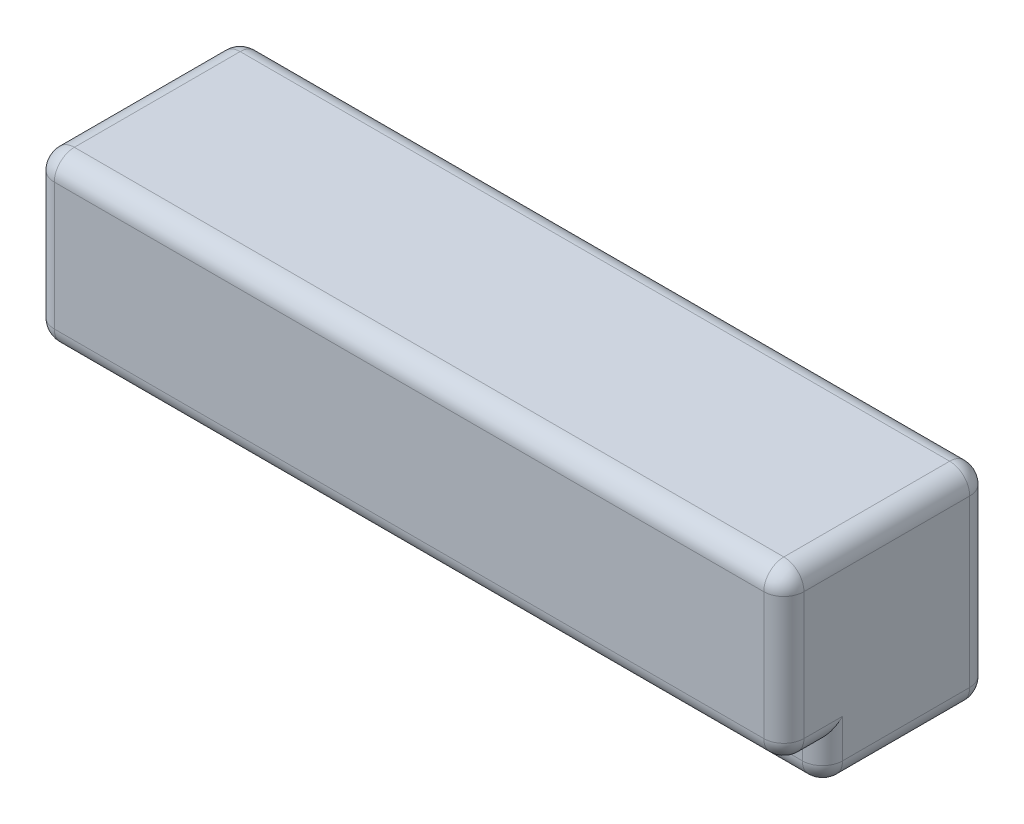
ISO-10303-21;
HEADER;
FILE_DESCRIPTION(('STEP AP214'),'2;1');
FILE_NAME('part.step','',(''),(''),'','','');
FILE_SCHEMA(('AUTOMOTIVE_DESIGN { 1 0 10303 214 1 1 1 1 }'));
ENDSEC;
DATA;
#1=APPLICATION_CONTEXT('core data for automotive mechanical design processes');
#2=APPLICATION_PROTOCOL_DEFINITION('international standard','automotive_design',2000,#1);
#3=PRODUCT_CONTEXT('',#1,'mechanical');
#4=PRODUCT('Part','Part','',(#3));
#5=PRODUCT_RELATED_PRODUCT_CATEGORY('part','',(#4));
#6=PRODUCT_DEFINITION_FORMATION('','',#4);
#7=PRODUCT_DEFINITION_CONTEXT('part definition',#1,'design');
#8=PRODUCT_DEFINITION('design','',#6,#7);
#9=PRODUCT_DEFINITION_SHAPE('','',#8);
#10=(LENGTH_UNIT() NAMED_UNIT(*) SI_UNIT(.MILLI.,.METRE.));
#11=(NAMED_UNIT(*) PLANE_ANGLE_UNIT() SI_UNIT($,.RADIAN.));
#12=(NAMED_UNIT(*) SI_UNIT($,.STERADIAN.) SOLID_ANGLE_UNIT());
#13=UNCERTAINTY_MEASURE_WITH_UNIT(LENGTH_MEASURE(1.E-05),#10,'distance_accuracy_value','');
#14=(GEOMETRIC_REPRESENTATION_CONTEXT(3) GLOBAL_UNCERTAINTY_ASSIGNED_CONTEXT((#13)) GLOBAL_UNIT_ASSIGNED_CONTEXT((#10,
#11,#12)) REPRESENTATION_CONTEXT('',''));
#15=CARTESIAN_POINT('',(0.,0.,0.));
#16=DIRECTION('',(0.,0.,1.));
#17=DIRECTION('',(1.,0.,0.));
#18=AXIS2_PLACEMENT_3D('',#15,#16,#17);
#19=CARTESIAN_POINT('',(-18.4912,-3.175,3.175));
#20=DIRECTION('',(0.,0.,1.));
#21=DIRECTION('',(1.,0.,0.));
#22=AXIS2_PLACEMENT_3D('',#19,#20,#21);
#23=PLANE('',#22);
#24=DIRECTION('',(1.,0.,0.));
#25=VECTOR('',#24,1.);
#26=CARTESIAN_POINT('',(-18.4912,-4.0894,3.175));
#27=LINE('',#26,#25);
#28=CARTESIAN_POINT('',(17.5006,-4.0894,3.175));
#29=VERTEX_POINT('',#28);
#30=CARTESIAN_POINT('',(-17.5006,-4.0894,3.175));
#31=VERTEX_POINT('',#30);
#32=EDGE_CURVE('E312',#29,#31,#27,.F.);
#33=ORIENTED_EDGE('',*,*,#32,.F.);
#34=DIRECTION('',(0.,1.,0.));
#35=VECTOR('',#34,1.);
#36=CARTESIAN_POINT('',(17.5006,-3.175,3.175));
#37=LINE('',#36,#35);
#38=CARTESIAN_POINT('',(17.5006,-3.175,3.175));
#39=VERTEX_POINT('',#38);
#40=EDGE_CURVE('E143',#29,#39,#37,.T.);
#41=ORIENTED_EDGE('',*,*,#40,.T.);
#42=DIRECTION('',(1.,0.,0.));
#43=VECTOR('',#42,1.);
#44=CARTESIAN_POINT('',(-18.4912,-3.175,3.175));
#45=LINE('',#44,#43);
#46=CARTESIAN_POINT('',(-17.5006,-3.175,3.175));
#47=VERTEX_POINT('',#46);
#48=EDGE_CURVE('E146',#47,#39,#45,.T.);
#49=ORIENTED_EDGE('',*,*,#48,.F.);
#50=DIRECTION('',(0.,1.,0.));
#51=VECTOR('',#50,1.);
#52=CARTESIAN_POINT('',(-17.5006,-3.175,3.175));
#53=LINE('',#52,#51);
#54=EDGE_CURVE('E133',#47,#31,#53,.F.);
#55=ORIENTED_EDGE('',*,*,#54,.T.);
#56=EDGE_LOOP('',(#33,#41,#49,#55));
#57=FACE_BOUND('',#56,.T.);
#58=ADVANCED_FACE('F16',(#57),#23,.T.);
#59=CARTESIAN_POINT('',(-18.4912,-4.0894,2.1844));
#60=DIRECTION('',(1.,0.,0.));
#61=DIRECTION('',(0.,0.,-1.));
#62=AXIS2_PLACEMENT_3D('',#59,#60,#61);
#63=CYLINDRICAL_SURFACE('',#62,0.9906);
#64=DIRECTION('',(1.,0.,0.));
#65=VECTOR('',#64,1.);
#66=CARTESIAN_POINT('',(-18.4912,-5.08,2.1844));
#67=LINE('',#66,#65);
#68=CARTESIAN_POINT('',(17.5006,-5.08,2.1844));
#69=VERTEX_POINT('',#68);
#70=CARTESIAN_POINT('',(-17.5006,-5.08,2.18439999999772));
#71=VERTEX_POINT('',#70);
#72=EDGE_CURVE('E259',#69,#71,#67,.F.);
#73=ORIENTED_EDGE('',*,*,#72,.F.);
#74=CARTESIAN_POINT('',(17.5006,-4.0894,2.1844));
#75=DIRECTION('',(1.,0.,0.));
#76=DIRECTION('',(0.,0.,-1.));
#77=AXIS2_PLACEMENT_3D('',#74,#75,#76);
#78=CIRCLE('',#77,0.9906);
#79=EDGE_CURVE('E309',#69,#29,#78,.F.);
#80=ORIENTED_EDGE('',*,*,#79,.T.);
#81=ORIENTED_EDGE('',*,*,#32,.T.);
#82=CARTESIAN_POINT('',(-17.5006,-4.0894,2.1844));
#83=DIRECTION('',(1.,0.,0.));
#84=DIRECTION('',(0.,0.,-1.));
#85=AXIS2_PLACEMENT_3D('',#82,#83,#84);
#86=CIRCLE('',#85,0.9906);
#87=EDGE_CURVE('E151',#71,#31,#86,.F.);
#88=ORIENTED_EDGE('',*,*,#87,.F.);
#89=EDGE_LOOP('',(#73,#80,#81,#88));
#90=FACE_BOUND('',#89,.T.);
#91=ADVANCED_FACE('F288',(#90),#63,.T.);
#92=CARTESIAN_POINT('',(-17.5006,-4.0894,-4.0894));
#93=DIRECTION('',(1.,0.,0.));
#94=DIRECTION('',(0.,0.,-1.));
#95=AXIS2_PLACEMENT_3D('',#92,#93,#94);
#96=SPHERICAL_SURFACE('',#95,0.9906);
#97=CARTESIAN_POINT('',(-17.5006,-4.0894,-4.0894));
#98=DIRECTION('',(0.,-1.,0.));
#99=DIRECTION('',(0.,0.,-1.));
#100=AXIS2_PLACEMENT_3D('',#97,#98,#99);
#101=CIRCLE('',#100,0.990599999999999);
#102=CARTESIAN_POINT('',(-17.5006,-4.0894,-5.08));
#103=VERTEX_POINT('',#102);
#104=CARTESIAN_POINT('',(-18.4912,-4.0894,-4.0894));
#105=VERTEX_POINT('',#104);
#106=EDGE_CURVE('E162',#103,#105,#101,.F.);
#107=ORIENTED_EDGE('',*,*,#106,.F.);
#108=CARTESIAN_POINT('',(-17.5006,-4.0894,-4.0894));
#109=DIRECTION('',(1.,0.,0.));
#110=DIRECTION('',(0.,0.,-1.));
#111=AXIS2_PLACEMENT_3D('',#108,#109,#110);
#112=CIRCLE('',#111,0.990599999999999);
#113=CARTESIAN_POINT('',(-17.5006,-5.08,-4.0894));
#114=VERTEX_POINT('',#113);
#115=EDGE_CURVE('E244',#114,#103,#112,.T.);
#116=ORIENTED_EDGE('',*,*,#115,.F.);
#117=CARTESIAN_POINT('',(-17.5006,-4.0894,-4.0894));
#118=DIRECTION('',(0.,0.,1.));
#119=DIRECTION('',(1.,0.,0.));
#120=AXIS2_PLACEMENT_3D('',#117,#118,#119);
#121=CIRCLE('',#120,0.990600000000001);
#122=EDGE_CURVE('E197',#105,#114,#121,.T.);
#123=ORIENTED_EDGE('',*,*,#122,.F.);
#124=EDGE_LOOP('',(#107,#116,#123));
#125=FACE_BOUND('',#124,.T.);
#126=ADVANCED_FACE('F284',(#125),#96,.T.);
#127=CARTESIAN_POINT('',(-17.5006,-4.0894,2.1844));
#128=DIRECTION('',(1.,0.,0.));
#129=DIRECTION('',(0.,0.,-1.));
#130=AXIS2_PLACEMENT_3D('',#127,#128,#129);
#131=SPHERICAL_SURFACE('',#130,0.9906);
#132=ORIENTED_EDGE('',*,*,#87,.T.);
#133=CARTESIAN_POINT('',(-17.5006,-4.0894,2.1844));
#134=DIRECTION('',(0.,1.,0.));
#135=DIRECTION('',(0.,0.,1.));
#136=AXIS2_PLACEMENT_3D('',#133,#134,#135);
#137=CIRCLE('',#136,0.9906);
#138=CARTESIAN_POINT('',(-18.4912,-4.0894,2.1844));
#139=VERTEX_POINT('',#138);
#140=EDGE_CURVE('E139',#139,#31,#137,.T.);
#141=ORIENTED_EDGE('',*,*,#140,.F.);
#142=CARTESIAN_POINT('',(-17.5006,-4.0894,2.1844));
#143=DIRECTION('',(0.,0.,1.));
#144=DIRECTION('',(1.,0.,0.));
#145=AXIS2_PLACEMENT_3D('',#142,#143,#144);
#146=CIRCLE('',#145,0.990600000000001);
#147=EDGE_CURVE('E191',#71,#139,#146,.F.);
#148=ORIENTED_EDGE('',*,*,#147,.F.);
#149=EDGE_LOOP('',(#132,#141,#148));
#150=FACE_BOUND('',#149,.T.);
#151=ADVANCED_FACE('F280',(#150),#131,.T.);
#152=CARTESIAN_POINT('',(-17.5006,-2.1844,4.0894));
#153=DIRECTION('',(1.,0.,0.));
#154=DIRECTION('',(0.,0.,-1.));
#155=AXIS2_PLACEMENT_3D('',#152,#153,#154);
#156=SPHERICAL_SURFACE('',#155,0.9906);
#157=CARTESIAN_POINT('',(-17.5006,-2.1844,4.0894));
#158=DIRECTION('',(1.,0.,0.));
#159=DIRECTION('',(0.,0.,-1.));
#160=AXIS2_PLACEMENT_3D('',#157,#158,#159);
#161=CIRCLE('',#160,0.9906);
#162=CARTESIAN_POINT('',(-17.5006,-2.1844,5.08));
#163=VERTEX_POINT('',#162);
#164=CARTESIAN_POINT('',(-17.5006,-3.175,4.0894));
#165=VERTEX_POINT('',#164);
#166=EDGE_CURVE('E170',#163,#165,#161,.T.);
#167=ORIENTED_EDGE('',*,*,#166,.F.);
#168=CARTESIAN_POINT('',(-17.5006,-2.1844,4.0894));
#169=DIRECTION('',(0.,1.,0.));
#170=DIRECTION('',(0.,0.,1.));
#171=AXIS2_PLACEMENT_3D('',#168,#169,#170);
#172=CIRCLE('',#171,0.990599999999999);
#173=CARTESIAN_POINT('',(-18.4912,-2.1844,4.0894));
#174=VERTEX_POINT('',#173);
#175=EDGE_CURVE('E168',#174,#163,#172,.T.);
#176=ORIENTED_EDGE('',*,*,#175,.F.);
#177=CARTESIAN_POINT('',(-17.5006,-2.1844,4.0894));
#178=DIRECTION('',(0.,0.,1.));
#179=DIRECTION('',(1.,0.,0.));
#180=AXIS2_PLACEMENT_3D('',#177,#178,#179);
#181=CIRCLE('',#180,0.990600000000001);
#182=EDGE_CURVE('E161',#165,#174,#181,.F.);
#183=ORIENTED_EDGE('',*,*,#182,.F.);
#184=EDGE_LOOP('',(#167,#176,#183));
#185=FACE_BOUND('',#184,.T.);
#186=ADVANCED_FACE('F277',(#185),#156,.T.);
#187=CARTESIAN_POINT('',(-18.4912,-3.175,5.08));
#188=DIRECTION('',(0.,-1.,0.));
#189=DIRECTION('',(0.,0.,-1.));
#190=AXIS2_PLACEMENT_3D('',#187,#188,#189);
#191=PLANE('',#190);
#192=ORIENTED_EDGE('',*,*,#48,.T.);
#193=DIRECTION('',(0.,0.,-1.));
#194=VECTOR('',#193,1.);
#195=CARTESIAN_POINT('',(17.5006,-3.175,5.08));
#196=LINE('',#195,#194);
#197=CARTESIAN_POINT('',(17.5006,-3.175,4.0894));
#198=VERTEX_POINT('',#197);
#199=EDGE_CURVE('E150',#39,#198,#196,.F.);
#200=ORIENTED_EDGE('',*,*,#199,.T.);
#201=DIRECTION('',(1.,0.,0.));
#202=VECTOR('',#201,1.);
#203=CARTESIAN_POINT('',(-18.4912,-3.175,4.0894));
#204=LINE('',#203,#202);
#205=EDGE_CURVE('E158',#165,#198,#204,.T.);
#206=ORIENTED_EDGE('',*,*,#205,.F.);
#207=DIRECTION('',(0.,0.,1.));
#208=VECTOR('',#207,1.);
#209=CARTESIAN_POINT('',(-17.5006,-3.175,5.08));
#210=LINE('',#209,#208);
#211=EDGE_CURVE('E155',#47,#165,#210,.T.);
#212=ORIENTED_EDGE('',*,*,#211,.F.);
#213=EDGE_LOOP('',(#192,#200,#206,#212));
#214=FACE_BOUND('',#213,.T.);
#215=ADVANCED_FACE('F156',(#214),#191,.T.);
#216=CARTESIAN_POINT('',(-18.4912,-5.08,3.175));
#217=DIRECTION('',(0.,-1.,0.));
#218=DIRECTION('',(0.,0.,-1.));
#219=AXIS2_PLACEMENT_3D('',#216,#217,#218);
#220=PLANE('',#219);
#221=DIRECTION('',(1.,0.,0.));
#222=VECTOR('',#221,1.);
#223=CARTESIAN_POINT('',(-18.4912,-5.08,-4.0894));
#224=LINE('',#223,#222);
#225=CARTESIAN_POINT('',(17.5006,-5.08,-4.08939999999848));
#226=VERTEX_POINT('',#225);
#227=EDGE_CURVE('E262',#226,#114,#224,.F.);
#228=ORIENTED_EDGE('',*,*,#227,.F.);
#229=DIRECTION('',(0.,0.,-1.));
#230=VECTOR('',#229,1.);
#231=CARTESIAN_POINT('',(17.5006,-5.08,5.08));
#232=LINE('',#231,#230);
#233=EDGE_CURVE('E252',#69,#226,#232,.T.);
#234=ORIENTED_EDGE('',*,*,#233,.F.);
#235=ORIENTED_EDGE('',*,*,#72,.T.);
#236=DIRECTION('',(0.,0.,1.));
#237=VECTOR('',#236,1.);
#238=CARTESIAN_POINT('',(-17.5006,-5.08,3.175));
#239=LINE('',#238,#237);
#240=EDGE_CURVE('E194',#114,#71,#239,.T.);
#241=ORIENTED_EDGE('',*,*,#240,.F.);
#242=EDGE_LOOP('',(#228,#234,#235,#241));
#243=FACE_BOUND('',#242,.T.);
#244=ADVANCED_FACE('F230',(#243),#220,.T.);
#245=CARTESIAN_POINT('',(17.5006,-4.0894,-4.0894));
#246=DIRECTION('',(1.,0.,0.));
#247=DIRECTION('',(0.,0.,-1.));
#248=AXIS2_PLACEMENT_3D('',#245,#246,#247);
#249=SPHERICAL_SURFACE('',#248,0.9906);
#250=CARTESIAN_POINT('',(17.5006,-4.0894,-4.0894));
#251=DIRECTION('',(1.,0.,0.));
#252=DIRECTION('',(0.,0.,-1.));
#253=AXIS2_PLACEMENT_3D('',#250,#251,#252);
#254=CIRCLE('',#253,0.990599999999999);
#255=CARTESIAN_POINT('',(17.5006,-4.0894,-5.08));
#256=VERTEX_POINT('',#255);
#257=EDGE_CURVE('E200',#256,#226,#254,.F.);
#258=ORIENTED_EDGE('',*,*,#257,.F.);
#259=CARTESIAN_POINT('',(17.5006,-4.0894,-4.0894));
#260=DIRECTION('',(0.,1.,0.));
#261=DIRECTION('',(0.,0.,1.));
#262=AXIS2_PLACEMENT_3D('',#259,#260,#261);
#263=CIRCLE('',#262,0.9906);
#264=CARTESIAN_POINT('',(18.4912,-4.0894,-4.0894));
#265=VERTEX_POINT('',#264);
#266=EDGE_CURVE('E375',#265,#256,#263,.T.);
#267=ORIENTED_EDGE('',*,*,#266,.F.);
#268=CARTESIAN_POINT('',(17.5006,-4.0894,-4.0894));
#269=DIRECTION('',(0.,0.,-1.));
#270=DIRECTION('',(-1.,0.,0.));
#271=AXIS2_PLACEMENT_3D('',#268,#269,#270);
#272=CIRCLE('',#271,0.990600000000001);
#273=EDGE_CURVE('E255',#226,#265,#272,.F.);
#274=ORIENTED_EDGE('',*,*,#273,.F.);
#275=EDGE_LOOP('',(#258,#267,#274));
#276=FACE_BOUND('',#275,.T.);
#277=ADVANCED_FACE('F226',(#276),#249,.T.);
#278=CARTESIAN_POINT('',(17.5006,-2.1844,4.0894));
#279=DIRECTION('',(1.,0.,0.));
#280=DIRECTION('',(0.,0.,-1.));
#281=AXIS2_PLACEMENT_3D('',#278,#279,#280);
#282=SPHERICAL_SURFACE('',#281,0.9906);
#283=CARTESIAN_POINT('',(17.5006,-2.1844,4.0894));
#284=DIRECTION('',(0.,0.,-1.));
#285=DIRECTION('',(-1.,0.,0.));
#286=AXIS2_PLACEMENT_3D('',#283,#284,#285);
#287=CIRCLE('',#286,0.990600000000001);
#288=CARTESIAN_POINT('',(18.4912,-2.1844,4.0894));
#289=VERTEX_POINT('',#288);
#290=EDGE_CURVE('E327',#289,#198,#287,.T.);
#291=ORIENTED_EDGE('',*,*,#290,.F.);
#292=CARTESIAN_POINT('',(17.5006,-2.1844,4.0894));
#293=DIRECTION('',(0.,-1.,0.));
#294=DIRECTION('',(0.,0.,-1.));
#295=AXIS2_PLACEMENT_3D('',#292,#293,#294);
#296=CIRCLE('',#295,0.9906);
#297=CARTESIAN_POINT('',(17.5006,-2.1844,5.08));
#298=VERTEX_POINT('',#297);
#299=EDGE_CURVE('E332',#298,#289,#296,.F.);
#300=ORIENTED_EDGE('',*,*,#299,.F.);
#301=CARTESIAN_POINT('',(17.5006,-2.1844,4.0894));
#302=DIRECTION('',(1.,0.,0.));
#303=DIRECTION('',(0.,0.,-1.));
#304=AXIS2_PLACEMENT_3D('',#301,#302,#303);
#305=CIRCLE('',#304,0.9906);
#306=EDGE_CURVE('E266',#198,#298,#305,.F.);
#307=ORIENTED_EDGE('',*,*,#306,.F.);
#308=EDGE_LOOP('',(#291,#300,#307));
#309=FACE_BOUND('',#308,.T.);
#310=ADVANCED_FACE('F221',(#309),#282,.T.);
#311=CARTESIAN_POINT('',(17.5006,-4.0894,2.1844));
#312=DIRECTION('',(1.,0.,0.));
#313=DIRECTION('',(0.,0.,-1.));
#314=AXIS2_PLACEMENT_3D('',#311,#312,#313);
#315=SPHERICAL_SURFACE('',#314,0.9906);
#316=ORIENTED_EDGE('',*,*,#79,.F.);
#317=CARTESIAN_POINT('',(17.5006,-4.0894,2.1844));
#318=DIRECTION('',(0.,0.,-1.));
#319=DIRECTION('',(-1.,0.,0.));
#320=AXIS2_PLACEMENT_3D('',#317,#318,#319);
#321=CIRCLE('',#320,0.990600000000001);
#322=CARTESIAN_POINT('',(18.4912,-4.0894,2.1844));
#323=VERTEX_POINT('',#322);
#324=EDGE_CURVE('E256',#323,#69,#321,.T.);
#325=ORIENTED_EDGE('',*,*,#324,.F.);
#326=CARTESIAN_POINT('',(17.5006,-4.0894,2.1844));
#327=DIRECTION('',(0.,-1.,0.));
#328=DIRECTION('',(0.,0.,-1.));
#329=AXIS2_PLACEMENT_3D('',#326,#327,#328);
#330=CIRCLE('',#329,0.9906);
#331=EDGE_CURVE('E323',#29,#323,#330,.F.);
#332=ORIENTED_EDGE('',*,*,#331,.F.);
#333=EDGE_LOOP('',(#316,#325,#332));
#334=FACE_BOUND('',#333,.T.);
#335=ADVANCED_FACE('F216',(#334),#315,.T.);
#336=CARTESIAN_POINT('',(-18.4912,-4.0894,-4.0894));
#337=DIRECTION('',(1.,0.,0.));
#338=DIRECTION('',(0.,0.,-1.));
#339=AXIS2_PLACEMENT_3D('',#336,#337,#338);
#340=CYLINDRICAL_SURFACE('',#339,0.990599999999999);
#341=DIRECTION('',(1.,0.,0.));
#342=VECTOR('',#341,1.);
#343=CARTESIAN_POINT('',(-18.4912,-4.0894,-5.08));
#344=LINE('',#343,#342);
#345=EDGE_CURVE('E235',#256,#103,#344,.F.);
#346=ORIENTED_EDGE('',*,*,#345,.F.);
#347=ORIENTED_EDGE('',*,*,#257,.T.);
#348=ORIENTED_EDGE('',*,*,#227,.T.);
#349=ORIENTED_EDGE('',*,*,#115,.T.);
#350=EDGE_LOOP('',(#346,#347,#348,#349));
#351=FACE_BOUND('',#350,.T.);
#352=ADVANCED_FACE('F220',(#351),#340,.T.);
#353=CARTESIAN_POINT('',(-17.5006,-4.0894,3.175));
#354=DIRECTION('',(0.,0.,1.));
#355=DIRECTION('',(1.,0.,0.));
#356=AXIS2_PLACEMENT_3D('',#353,#354,#355);
#357=CYLINDRICAL_SURFACE('',#356,0.990600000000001);
#358=ORIENTED_EDGE('',*,*,#147,.T.);
#359=DIRECTION('',(0.,0.,-1.));
#360=VECTOR('',#359,1.);
#361=CARTESIAN_POINT('',(-18.4912,-4.0894,5.08));
#362=LINE('',#361,#360);
#363=EDGE_CURVE('E180',#139,#105,#362,.T.);
#364=ORIENTED_EDGE('',*,*,#363,.T.);
#365=ORIENTED_EDGE('',*,*,#122,.T.);
#366=ORIENTED_EDGE('',*,*,#240,.T.);
#367=EDGE_LOOP('',(#358,#364,#365,#366));
#368=FACE_BOUND('',#367,.T.);
#369=ADVANCED_FACE('F458',(#368),#357,.T.);
#370=CARTESIAN_POINT('',(-17.5006,5.08,-4.0894));
#371=DIRECTION('',(0.,-1.,0.));
#372=DIRECTION('',(0.,0.,-1.));
#373=AXIS2_PLACEMENT_3D('',#370,#371,#372);
#374=CYLINDRICAL_SURFACE('',#373,0.990599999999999);
#375=CARTESIAN_POINT('',(-17.5006,4.0894,-4.0894));
#376=DIRECTION('',(0.,1.,0.));
#377=DIRECTION('',(1.,0.,0.));
#378=AXIS2_PLACEMENT_3D('',#375,#376,#377);
#379=CIRCLE('',#378,0.9906);
#380=CARTESIAN_POINT('',(-17.5006,4.0894,-5.08));
#381=VERTEX_POINT('',#380);
#382=CARTESIAN_POINT('',(-18.4912,4.0894,-4.0894));
#383=VERTEX_POINT('',#382);
#384=EDGE_CURVE('E184',#381,#383,#379,.T.);
#385=ORIENTED_EDGE('',*,*,#384,.F.);
#386=DIRECTION('',(0.,1.,0.));
#387=VECTOR('',#386,1.);
#388=CARTESIAN_POINT('',(-17.5006,5.08,-5.08));
#389=LINE('',#388,#387);
#390=EDGE_CURVE('E238',#103,#381,#389,.T.);
#391=ORIENTED_EDGE('',*,*,#390,.F.);
#392=ORIENTED_EDGE('',*,*,#106,.T.);
#393=DIRECTION('',(0.,1.,0.));
#394=VECTOR('',#393,1.);
#395=CARTESIAN_POINT('',(-18.4912,-3.175,-4.0894));
#396=LINE('',#395,#394);
#397=EDGE_CURVE('E183',#105,#383,#396,.T.);
#398=ORIENTED_EDGE('',*,*,#397,.T.);
#399=EDGE_LOOP('',(#385,#391,#392,#398));
#400=FACE_BOUND('',#399,.T.);
#401=ADVANCED_FACE('F463',(#400),#374,.T.);
#402=CARTESIAN_POINT('',(-17.5006,-2.1844,5.08));
#403=DIRECTION('',(0.,0.,1.));
#404=DIRECTION('',(1.,0.,0.));
#405=AXIS2_PLACEMENT_3D('',#402,#403,#404);
#406=CYLINDRICAL_SURFACE('',#405,0.990600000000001);
#407=ORIENTED_EDGE('',*,*,#182,.T.);
#408=DIRECTION('',(0.,0.,-1.));
#409=VECTOR('',#408,1.);
#410=CARTESIAN_POINT('',(-18.4912,-2.1844,5.08));
#411=LINE('',#410,#409);
#412=CARTESIAN_POINT('',(-18.4912,-2.1844,2.1844));
#413=VERTEX_POINT('',#412);
#414=EDGE_CURVE('E167',#174,#413,#411,.T.);
#415=ORIENTED_EDGE('',*,*,#414,.T.);
#416=CARTESIAN_POINT('',(-17.5006,-2.1844,2.1844));
#417=DIRECTION('',(0.,0.707106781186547,0.707106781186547));
#418=DIRECTION('',(0.,-0.707106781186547,0.707106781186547));
#419=AXIS2_PLACEMENT_3D('',#416,#417,#418);
#420=ELLIPSE('',#419,1.40091995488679,0.990600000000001);
#421=EDGE_CURVE('E19',#47,#413,#420,.F.);
#422=ORIENTED_EDGE('',*,*,#421,.F.);
#423=ORIENTED_EDGE('',*,*,#211,.T.);
#424=EDGE_LOOP('',(#407,#415,#422,#423));
#425=FACE_BOUND('',#424,.T.);
#426=ADVANCED_FACE('F165',(#425),#406,.T.);
#427=CARTESIAN_POINT('',(-17.5006,-3.175,2.1844));
#428=DIRECTION('',(0.,1.,0.));
#429=DIRECTION('',(0.,0.,1.));
#430=AXIS2_PLACEMENT_3D('',#427,#428,#429);
#431=CYLINDRICAL_SURFACE('',#430,0.9906);
#432=ORIENTED_EDGE('',*,*,#421,.T.);
#433=DIRECTION('',(0.,1.,0.));
#434=VECTOR('',#433,1.);
#435=CARTESIAN_POINT('',(-18.4912,-3.175,2.1844));
#436=LINE('',#435,#434);
#437=EDGE_CURVE('E428',#413,#139,#436,.F.);
#438=ORIENTED_EDGE('',*,*,#437,.T.);
#439=ORIENTED_EDGE('',*,*,#140,.T.);
#440=ORIENTED_EDGE('',*,*,#54,.F.);
#441=EDGE_LOOP('',(#432,#438,#439,#440));
#442=FACE_BOUND('',#441,.T.);
#443=ADVANCED_FACE('F135',(#442),#431,.T.);
#444=CARTESIAN_POINT('',(-17.5006,5.08,4.0894));
#445=DIRECTION('',(0.,1.,0.));
#446=DIRECTION('',(0.,0.,1.));
#447=AXIS2_PLACEMENT_3D('',#444,#445,#446);
#448=CYLINDRICAL_SURFACE('',#447,0.990599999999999);
#449=ORIENTED_EDGE('',*,*,#175,.T.);
#450=DIRECTION('',(0.,1.,0.));
#451=VECTOR('',#450,1.);
#452=CARTESIAN_POINT('',(-17.5006,5.08,5.08));
#453=LINE('',#452,#451);
#454=CARTESIAN_POINT('',(-17.5006,4.08939999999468,5.08));
#455=VERTEX_POINT('',#454);
#456=EDGE_CURVE('E408',#455,#163,#453,.F.);
#457=ORIENTED_EDGE('',*,*,#456,.F.);
#458=CARTESIAN_POINT('',(-17.5006,4.0894,4.0894));
#459=DIRECTION('',(0.,-1.,-1.22660656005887E-11));
#460=DIRECTION('',(1.,0.,0.));
#461=AXIS2_PLACEMENT_3D('',#458,#459,#460);
#462=CIRCLE('',#461,0.9906);
#463=CARTESIAN_POINT('',(-18.4912,4.0894,4.0894));
#464=VERTEX_POINT('',#463);
#465=EDGE_CURVE('E421',#464,#455,#462,.F.);
#466=ORIENTED_EDGE('',*,*,#465,.F.);
#467=DIRECTION('',(0.,1.,0.));
#468=VECTOR('',#467,1.);
#469=CARTESIAN_POINT('',(-18.4912,-3.175,4.0894));
#470=LINE('',#469,#468);
#471=EDGE_CURVE('E208',#464,#174,#470,.F.);
#472=ORIENTED_EDGE('',*,*,#471,.T.);
#473=EDGE_LOOP('',(#449,#457,#466,#472));
#474=FACE_BOUND('',#473,.T.);
#475=ADVANCED_FACE('F558',(#474),#448,.T.);
#476=CARTESIAN_POINT('',(-18.4912,-2.1844,4.0894));
#477=DIRECTION('',(1.,0.,0.));
#478=DIRECTION('',(0.,0.,-1.));
#479=AXIS2_PLACEMENT_3D('',#476,#477,#478);
#480=CYLINDRICAL_SURFACE('',#479,0.9906);
#481=ORIENTED_EDGE('',*,*,#205,.T.);
#482=ORIENTED_EDGE('',*,*,#306,.T.);
#483=DIRECTION('',(1.,0.,0.));
#484=VECTOR('',#483,1.);
#485=CARTESIAN_POINT('',(-18.4912,-2.1844,5.08));
#486=LINE('',#485,#484);
#487=EDGE_CURVE('E394',#163,#298,#486,.T.);
#488=ORIENTED_EDGE('',*,*,#487,.F.);
#489=ORIENTED_EDGE('',*,*,#166,.T.);
#490=EDGE_LOOP('',(#481,#482,#488,#489));
#491=FACE_BOUND('',#490,.T.);
#492=ADVANCED_FACE('F555',(#491),#480,.T.);
#493=CARTESIAN_POINT('',(17.5006,-4.0894,5.08));
#494=DIRECTION('',(0.,0.,-1.));
#495=DIRECTION('',(-1.,0.,0.));
#496=AXIS2_PLACEMENT_3D('',#493,#494,#495);
#497=CYLINDRICAL_SURFACE('',#496,0.990600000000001);
#498=ORIENTED_EDGE('',*,*,#273,.T.);
#499=DIRECTION('',(0.,0.,-1.));
#500=VECTOR('',#499,1.);
#501=CARTESIAN_POINT('',(18.4912,-4.0894,5.08));
#502=LINE('',#501,#500);
#503=EDGE_CURVE('E340',#323,#265,#502,.T.);
#504=ORIENTED_EDGE('',*,*,#503,.F.);
#505=ORIENTED_EDGE('',*,*,#324,.T.);
#506=ORIENTED_EDGE('',*,*,#233,.T.);
#507=EDGE_LOOP('',(#498,#504,#505,#506));
#508=FACE_BOUND('',#507,.T.);
#509=ADVANCED_FACE('F471',(#508),#497,.T.);
#510=CARTESIAN_POINT('',(17.5006,-3.175,-4.0894));
#511=DIRECTION('',(0.,1.,0.));
#512=DIRECTION('',(0.,0.,1.));
#513=AXIS2_PLACEMENT_3D('',#510,#511,#512);
#514=CYLINDRICAL_SURFACE('',#513,0.9906);
#515=CARTESIAN_POINT('',(17.5006,4.0894,-4.0894));
#516=DIRECTION('',(0.,1.,0.));
#517=DIRECTION('',(0.,0.,1.));
#518=AXIS2_PLACEMENT_3D('',#515,#516,#517);
#519=CIRCLE('',#518,0.9906);
#520=CARTESIAN_POINT('',(17.5006,4.0894,-5.08));
#521=VERTEX_POINT('',#520);
#522=CARTESIAN_POINT('',(18.4912,4.0894,-4.0894));
#523=VERTEX_POINT('',#522);
#524=EDGE_CURVE('E357',#521,#523,#519,.F.);
#525=ORIENTED_EDGE('',*,*,#524,.T.);
#526=DIRECTION('',(0.,1.,0.));
#527=VECTOR('',#526,1.);
#528=CARTESIAN_POINT('',(18.4912,-3.175,-4.0894));
#529=LINE('',#528,#527);
#530=EDGE_CURVE('E343',#265,#523,#529,.T.);
#531=ORIENTED_EDGE('',*,*,#530,.F.);
#532=ORIENTED_EDGE('',*,*,#266,.T.);
#533=DIRECTION('',(0.,1.,0.));
#534=VECTOR('',#533,1.);
#535=CARTESIAN_POINT('',(17.5006,5.08,-5.08));
#536=LINE('',#535,#534);
#537=EDGE_CURVE('E247',#521,#256,#536,.F.);
#538=ORIENTED_EDGE('',*,*,#537,.F.);
#539=EDGE_LOOP('',(#525,#531,#532,#538));
#540=FACE_BOUND('',#539,.T.);
#541=ADVANCED_FACE('F476',(#540),#514,.T.);
#542=CARTESIAN_POINT('',(17.5006,-3.175,4.0894));
#543=DIRECTION('',(0.,-1.,0.));
#544=DIRECTION('',(0.,0.,-1.));
#545=AXIS2_PLACEMENT_3D('',#542,#543,#544);
#546=CYLINDRICAL_SURFACE('',#545,0.9906);
#547=CARTESIAN_POINT('',(17.5006,4.0894,4.0894));
#548=DIRECTION('',(0.,-1.,0.));
#549=DIRECTION('',(1.,0.,0.));
#550=AXIS2_PLACEMENT_3D('',#547,#548,#549);
#551=CIRCLE('',#550,0.9906);
#552=CARTESIAN_POINT('',(17.5006,4.0894,5.08));
#553=VERTEX_POINT('',#552);
#554=CARTESIAN_POINT('',(18.4912,4.0894,4.0894));
#555=VERTEX_POINT('',#554);
#556=EDGE_CURVE('E344',#553,#555,#551,.F.);
#557=ORIENTED_EDGE('',*,*,#556,.F.);
#558=DIRECTION('',(0.,1.,0.));
#559=VECTOR('',#558,1.);
#560=CARTESIAN_POINT('',(17.5006,5.08,5.08));
#561=LINE('',#560,#559);
#562=EDGE_CURVE('E361',#298,#553,#561,.T.);
#563=ORIENTED_EDGE('',*,*,#562,.F.);
#564=ORIENTED_EDGE('',*,*,#299,.T.);
#565=DIRECTION('',(0.,1.,0.));
#566=VECTOR('',#565,1.);
#567=CARTESIAN_POINT('',(18.4912,-3.175,4.0894));
#568=LINE('',#567,#566);
#569=EDGE_CURVE('E349',#555,#289,#568,.F.);
#570=ORIENTED_EDGE('',*,*,#569,.F.);
#571=EDGE_LOOP('',(#557,#563,#564,#570));
#572=FACE_BOUND('',#571,.T.);
#573=ADVANCED_FACE('F546',(#572),#546,.T.);
#574=CARTESIAN_POINT('',(17.5006,-2.1844,5.08));
#575=DIRECTION('',(0.,0.,-1.));
#576=DIRECTION('',(-1.,0.,0.));
#577=AXIS2_PLACEMENT_3D('',#574,#575,#576);
#578=CYLINDRICAL_SURFACE('',#577,0.990600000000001);
#579=ORIENTED_EDGE('',*,*,#290,.T.);
#580=ORIENTED_EDGE('',*,*,#199,.F.);
#581=CARTESIAN_POINT('',(17.5006,-2.1844,2.1844));
#582=DIRECTION('',(0.,-0.707106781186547,-0.707106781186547));
#583=DIRECTION('',(0.,-0.707106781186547,0.707106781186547));
#584=AXIS2_PLACEMENT_3D('',#581,#582,#583);
#585=ELLIPSE('',#584,1.40091995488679,0.990600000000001);
#586=CARTESIAN_POINT('',(18.4912,-2.1844,2.1844));
#587=VERTEX_POINT('',#586);
#588=EDGE_CURVE('E239',#587,#39,#585,.T.);
#589=ORIENTED_EDGE('',*,*,#588,.F.);
#590=DIRECTION('',(0.,0.,-1.));
#591=VECTOR('',#590,1.);
#592=CARTESIAN_POINT('',(18.4912,-2.1844,5.08));
#593=LINE('',#592,#591);
#594=EDGE_CURVE('E352',#289,#587,#593,.T.);
#595=ORIENTED_EDGE('',*,*,#594,.F.);
#596=EDGE_LOOP('',(#579,#580,#589,#595));
#597=FACE_BOUND('',#596,.T.);
#598=ADVANCED_FACE('F543',(#597),#578,.T.);
#599=CARTESIAN_POINT('',(17.5006,-3.175,2.1844));
#600=DIRECTION('',(0.,-1.,0.));
#601=DIRECTION('',(0.,0.,-1.));
#602=AXIS2_PLACEMENT_3D('',#599,#600,#601);
#603=CYLINDRICAL_SURFACE('',#602,0.9906);
#604=ORIENTED_EDGE('',*,*,#588,.T.);
#605=ORIENTED_EDGE('',*,*,#40,.F.);
#606=ORIENTED_EDGE('',*,*,#331,.T.);
#607=DIRECTION('',(0.,1.,0.));
#608=VECTOR('',#607,1.);
#609=CARTESIAN_POINT('',(18.4912,-3.175,2.1844));
#610=LINE('',#609,#608);
#611=EDGE_CURVE('E487',#587,#323,#610,.F.);
#612=ORIENTED_EDGE('',*,*,#611,.F.);
#613=EDGE_LOOP('',(#604,#605,#606,#612));
#614=FACE_BOUND('',#613,.T.);
#615=ADVANCED_FACE('F540',(#614),#603,.T.);
#616=CARTESIAN_POINT('',(-18.4912,5.08,-5.08));
#617=DIRECTION('',(0.,0.,-1.));
#618=DIRECTION('',(0.,1.,0.));
#619=AXIS2_PLACEMENT_3D('',#616,#617,#618);
#620=PLANE('',#619);
#621=DIRECTION('',(1.,0.,0.));
#622=VECTOR('',#621,1.);
#623=CARTESIAN_POINT('',(-18.4912,4.0894,-5.08));
#624=LINE('',#623,#622);
#625=EDGE_CURVE('E481',#521,#381,#624,.F.);
#626=ORIENTED_EDGE('',*,*,#625,.F.);
#627=ORIENTED_EDGE('',*,*,#537,.T.);
#628=ORIENTED_EDGE('',*,*,#345,.T.);
#629=ORIENTED_EDGE('',*,*,#390,.T.);
#630=EDGE_LOOP('',(#626,#627,#628,#629));
#631=FACE_BOUND('',#630,.T.);
#632=ADVANCED_FACE('F479',(#631),#620,.T.);
#633=CARTESIAN_POINT('',(-17.5006,4.0894,-4.0894));
#634=DIRECTION('',(1.,0.,0.));
#635=DIRECTION('',(0.,0.,-1.));
#636=AXIS2_PLACEMENT_3D('',#633,#634,#635);
#637=SPHERICAL_SURFACE('',#636,0.9906);
#638=ORIENTED_EDGE('',*,*,#384,.T.);
#639=CARTESIAN_POINT('',(-17.5006,4.0894,-4.0894));
#640=DIRECTION('',(0.,0.,-1.));
#641=DIRECTION('',(0.,1.,0.));
#642=AXIS2_PLACEMENT_3D('',#639,#640,#641);
#643=CIRCLE('',#642,0.990599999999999);
#644=CARTESIAN_POINT('',(-17.5006,5.08,-4.08939999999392));
#645=VERTEX_POINT('',#644);
#646=EDGE_CURVE('E447',#645,#383,#643,.F.);
#647=ORIENTED_EDGE('',*,*,#646,.F.);
#648=CARTESIAN_POINT('',(-17.5006,4.0894,-4.0894));
#649=DIRECTION('',(1.,0.,0.));
#650=DIRECTION('',(0.,0.,-1.));
#651=AXIS2_PLACEMENT_3D('',#648,#649,#650);
#652=CIRCLE('',#651,0.990599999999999);
#653=EDGE_CURVE('E486',#381,#645,#652,.T.);
#654=ORIENTED_EDGE('',*,*,#653,.F.);
#655=EDGE_LOOP('',(#638,#647,#654));
#656=FACE_BOUND('',#655,.T.);
#657=ADVANCED_FACE('F534',(#656),#637,.T.);
#658=CARTESIAN_POINT('',(-18.4912,-3.175,5.08));
#659=DIRECTION('',(1.,0.,0.));
#660=DIRECTION('',(0.,0.,-1.));
#661=AXIS2_PLACEMENT_3D('',#658,#659,#660);
#662=PLANE('',#661);
#663=ORIENTED_EDGE('',*,*,#414,.F.);
#664=ORIENTED_EDGE('',*,*,#471,.F.);
#665=DIRECTION('',(0.,0.,-1.));
#666=VECTOR('',#665,1.);
#667=CARTESIAN_POINT('',(-18.4912,4.0894,5.08));
#668=LINE('',#667,#666);
#669=EDGE_CURVE('E442',#383,#464,#668,.F.);
#670=ORIENTED_EDGE('',*,*,#669,.F.);
#671=ORIENTED_EDGE('',*,*,#397,.F.);
#672=ORIENTED_EDGE('',*,*,#363,.F.);
#673=ORIENTED_EDGE('',*,*,#437,.F.);
#674=EDGE_LOOP('',(#663,#664,#670,#671,#672,#673));
#675=FACE_BOUND('',#674,.T.);
#676=ADVANCED_FACE('F455',(#675),#662,.F.);
#677=CARTESIAN_POINT('',(-17.5006,4.0894,4.0894));
#678=DIRECTION('',(1.,0.,0.));
#679=DIRECTION('',(0.,0.,-1.));
#680=AXIS2_PLACEMENT_3D('',#677,#678,#679);
#681=SPHERICAL_SURFACE('',#680,0.9906);
#682=CARTESIAN_POINT('',(-17.5006,4.0894,4.0894));
#683=DIRECTION('',(0.,0.,-1.));
#684=DIRECTION('',(0.,1.,0.));
#685=AXIS2_PLACEMENT_3D('',#682,#683,#684);
#686=CIRCLE('',#685,0.990599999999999);
#687=CARTESIAN_POINT('',(-17.5006,5.08,4.0894));
#688=VERTEX_POINT('',#687);
#689=EDGE_CURVE('E433',#464,#688,#686,.T.);
#690=ORIENTED_EDGE('',*,*,#689,.F.);
#691=ORIENTED_EDGE('',*,*,#465,.T.);
#692=CARTESIAN_POINT('',(-17.5006,4.0894,4.0894));
#693=DIRECTION('',(1.,0.,0.));
#694=DIRECTION('',(0.,0.,-1.));
#695=AXIS2_PLACEMENT_3D('',#692,#693,#694);
#696=CIRCLE('',#695,0.9906);
#697=EDGE_CURVE('E403',#688,#455,#696,.T.);
#698=ORIENTED_EDGE('',*,*,#697,.F.);
#699=EDGE_LOOP('',(#690,#691,#698));
#700=FACE_BOUND('',#699,.T.);
#701=ADVANCED_FACE('F523',(#700),#681,.T.);
#702=CARTESIAN_POINT('',(-18.4912,5.08,5.08));
#703=DIRECTION('',(0.,0.,1.));
#704=DIRECTION('',(1.,0.,0.));
#705=AXIS2_PLACEMENT_3D('',#702,#703,#704);
#706=PLANE('',#705);
#707=ORIENTED_EDGE('',*,*,#487,.T.);
#708=ORIENTED_EDGE('',*,*,#562,.T.);
#709=DIRECTION('',(1.,0.,0.));
#710=VECTOR('',#709,1.);
#711=CARTESIAN_POINT('',(-18.4912,4.0894,5.08));
#712=LINE('',#711,#710);
#713=EDGE_CURVE('E398',#455,#553,#712,.T.);
#714=ORIENTED_EDGE('',*,*,#713,.F.);
#715=ORIENTED_EDGE('',*,*,#456,.T.);
#716=EDGE_LOOP('',(#707,#708,#714,#715));
#717=FACE_BOUND('',#716,.T.);
#718=ADVANCED_FACE('F520',(#717),#706,.T.);
#719=CARTESIAN_POINT('',(17.5006,4.0894,4.0894));
#720=DIRECTION('',(1.,0.,0.));
#721=DIRECTION('',(0.,0.,-1.));
#722=AXIS2_PLACEMENT_3D('',#719,#720,#721);
#723=SPHERICAL_SURFACE('',#722,0.9906);
#724=ORIENTED_EDGE('',*,*,#556,.T.);
#725=CARTESIAN_POINT('',(17.5006,4.0894,4.0894));
#726=DIRECTION('',(0.,0.,1.));
#727=DIRECTION('',(0.,-1.,0.));
#728=AXIS2_PLACEMENT_3D('',#725,#726,#727);
#729=CIRCLE('',#728,0.9906);
#730=CARTESIAN_POINT('',(17.5006,5.08,4.08939999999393));
#731=VERTEX_POINT('',#730);
#732=EDGE_CURVE('E34',#731,#555,#729,.F.);
#733=ORIENTED_EDGE('',*,*,#732,.F.);
#734=CARTESIAN_POINT('',(17.5006,4.0894,4.0894));
#735=DIRECTION('',(1.,0.,0.));
#736=DIRECTION('',(0.,0.,-1.));
#737=AXIS2_PLACEMENT_3D('',#734,#735,#736);
#738=CIRCLE('',#737,0.9906);
#739=EDGE_CURVE('E371',#553,#731,#738,.F.);
#740=ORIENTED_EDGE('',*,*,#739,.F.);
#741=EDGE_LOOP('',(#724,#733,#740));
#742=FACE_BOUND('',#741,.T.);
#743=ADVANCED_FACE('F516',(#742),#723,.T.);
#744=CARTESIAN_POINT('',(18.4912,-3.175,5.08));
#745=DIRECTION('',(1.,0.,0.));
#746=DIRECTION('',(0.,0.,-1.));
#747=AXIS2_PLACEMENT_3D('',#744,#745,#746);
#748=PLANE('',#747);
#749=ORIENTED_EDGE('',*,*,#594,.T.);
#750=ORIENTED_EDGE('',*,*,#611,.T.);
#751=ORIENTED_EDGE('',*,*,#503,.T.);
#752=ORIENTED_EDGE('',*,*,#530,.T.);
#753=DIRECTION('',(0.,0.,1.));
#754=VECTOR('',#753,1.);
#755=CARTESIAN_POINT('',(18.4912,4.0894,5.08));
#756=LINE('',#755,#754);
#757=EDGE_CURVE('E364',#555,#523,#756,.F.);
#758=ORIENTED_EDGE('',*,*,#757,.F.);
#759=ORIENTED_EDGE('',*,*,#569,.T.);
#760=EDGE_LOOP('',(#749,#750,#751,#752,#758,#759));
#761=FACE_BOUND('',#760,.T.);
#762=ADVANCED_FACE('F512',(#761),#748,.T.);
#763=CARTESIAN_POINT('',(17.5006,4.0894,-4.0894));
#764=DIRECTION('',(1.,0.,0.));
#765=DIRECTION('',(0.,0.,-1.));
#766=AXIS2_PLACEMENT_3D('',#763,#764,#765);
#767=SPHERICAL_SURFACE('',#766,0.9906);
#768=CARTESIAN_POINT('',(17.5006,4.0894,-4.0894));
#769=DIRECTION('',(1.,0.,0.));
#770=DIRECTION('',(0.,0.,-1.));
#771=AXIS2_PLACEMENT_3D('',#768,#769,#770);
#772=CIRCLE('',#771,0.990599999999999);
#773=CARTESIAN_POINT('',(17.5006,5.08,-4.0894));
#774=VERTEX_POINT('',#773);
#775=EDGE_CURVE('E490',#774,#521,#772,.F.);
#776=ORIENTED_EDGE('',*,*,#775,.F.);
#777=CARTESIAN_POINT('',(17.5006,4.0894,-4.0894));
#778=DIRECTION('',(0.,0.,1.));
#779=DIRECTION('',(0.,-1.,0.));
#780=AXIS2_PLACEMENT_3D('',#777,#778,#779);
#781=CIRCLE('',#780,0.9906);
#782=EDGE_CURVE('E367',#523,#774,#781,.T.);
#783=ORIENTED_EDGE('',*,*,#782,.F.);
#784=ORIENTED_EDGE('',*,*,#524,.F.);
#785=EDGE_LOOP('',(#776,#783,#784));
#786=FACE_BOUND('',#785,.T.);
#787=ADVANCED_FACE('F508',(#786),#767,.T.);
#788=CARTESIAN_POINT('',(-18.4912,4.0894,-4.0894));
#789=DIRECTION('',(1.,0.,0.));
#790=DIRECTION('',(0.,0.,-1.));
#791=AXIS2_PLACEMENT_3D('',#788,#789,#790);
#792=CYLINDRICAL_SURFACE('',#791,0.990599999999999);
#793=DIRECTION('',(1.,0.,0.));
#794=VECTOR('',#793,1.);
#795=CARTESIAN_POINT('',(-18.4912,5.08,-4.0894));
#796=LINE('',#795,#794);
#797=EDGE_CURVE('E493',#774,#645,#796,.F.);
#798=ORIENTED_EDGE('',*,*,#797,.F.);
#799=ORIENTED_EDGE('',*,*,#775,.T.);
#800=ORIENTED_EDGE('',*,*,#625,.T.);
#801=ORIENTED_EDGE('',*,*,#653,.T.);
#802=EDGE_LOOP('',(#798,#799,#800,#801));
#803=FACE_BOUND('',#802,.T.);
#804=ADVANCED_FACE('F491',(#803),#792,.T.);
#805=CARTESIAN_POINT('',(-17.5006,4.0894,5.08));
#806=DIRECTION('',(0.,0.,-1.));
#807=DIRECTION('',(0.,1.,0.));
#808=AXIS2_PLACEMENT_3D('',#805,#806,#807);
#809=CYLINDRICAL_SURFACE('',#808,0.990599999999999);
#810=ORIENTED_EDGE('',*,*,#689,.T.);
#811=DIRECTION('',(0.,0.,1.));
#812=VECTOR('',#811,1.);
#813=CARTESIAN_POINT('',(-17.5006,5.08,5.08));
#814=LINE('',#813,#812);
#815=EDGE_CURVE('E598',#645,#688,#814,.T.);
#816=ORIENTED_EDGE('',*,*,#815,.F.);
#817=ORIENTED_EDGE('',*,*,#646,.T.);
#818=ORIENTED_EDGE('',*,*,#669,.T.);
#819=EDGE_LOOP('',(#810,#816,#817,#818));
#820=FACE_BOUND('',#819,.T.);
#821=ADVANCED_FACE('F587',(#820),#809,.T.);
#822=CARTESIAN_POINT('',(-18.4912,4.0894,4.0894));
#823=DIRECTION('',(1.,0.,0.));
#824=DIRECTION('',(0.,0.,-1.));
#825=AXIS2_PLACEMENT_3D('',#822,#823,#824);
#826=CYLINDRICAL_SURFACE('',#825,0.9906);
#827=ORIENTED_EDGE('',*,*,#713,.T.);
#828=ORIENTED_EDGE('',*,*,#739,.T.);
#829=DIRECTION('',(1.,0.,0.));
#830=VECTOR('',#829,1.);
#831=CARTESIAN_POINT('',(-18.4912,5.08,4.0894));
#832=LINE('',#831,#830);
#833=EDGE_CURVE('E25',#688,#731,#832,.T.);
#834=ORIENTED_EDGE('',*,*,#833,.F.);
#835=ORIENTED_EDGE('',*,*,#697,.T.);
#836=EDGE_LOOP('',(#827,#828,#834,#835));
#837=FACE_BOUND('',#836,.T.);
#838=ADVANCED_FACE('F581',(#837),#826,.T.);
#839=CARTESIAN_POINT('',(17.5006,4.0894,5.08));
#840=DIRECTION('',(0.,0.,1.));
#841=DIRECTION('',(0.,-1.,0.));
#842=AXIS2_PLACEMENT_3D('',#839,#840,#841);
#843=CYLINDRICAL_SURFACE('',#842,0.9906);
#844=ORIENTED_EDGE('',*,*,#782,.T.);
#845=DIRECTION('',(0.,0.,1.));
#846=VECTOR('',#845,1.);
#847=CARTESIAN_POINT('',(17.5006,5.08,5.08));
#848=LINE('',#847,#846);
#849=EDGE_CURVE('E11',#731,#774,#848,.F.);
#850=ORIENTED_EDGE('',*,*,#849,.F.);
#851=ORIENTED_EDGE('',*,*,#732,.T.);
#852=ORIENTED_EDGE('',*,*,#757,.T.);
#853=EDGE_LOOP('',(#844,#850,#851,#852));
#854=FACE_BOUND('',#853,.T.);
#855=ADVANCED_FACE('F575',(#854),#843,.T.);
#856=CARTESIAN_POINT('',(-18.4912,5.08,5.08));
#857=DIRECTION('',(0.,1.,0.));
#858=DIRECTION('',(0.,0.,1.));
#859=AXIS2_PLACEMENT_3D('',#856,#857,#858);
#860=PLANE('',#859);
#861=ORIENTED_EDGE('',*,*,#833,.T.);
#862=ORIENTED_EDGE('',*,*,#849,.T.);
#863=ORIENTED_EDGE('',*,*,#797,.T.);
#864=ORIENTED_EDGE('',*,*,#815,.T.);
#865=EDGE_LOOP('',(#861,#862,#863,#864));
#866=FACE_BOUND('',#865,.T.);
#867=ADVANCED_FACE('F573',(#866),#860,.T.);
#868=CLOSED_SHELL('',(#58,#91,#126,#151,#186,#215,#244,#277,#310,#335,#352,#369,#401,#426,#443,
#475,#492,#509,#541,#573,#598,#615,#632,#657,#676,#701,#718,#743,#762,#787,#804,#821,#838,#855,#867));
#869=MANIFOLD_SOLID_BREP('B1',#868);
#870=ADVANCED_BREP_SHAPE_REPRESENTATION('',(#18,#869),#14);
#871=SHAPE_DEFINITION_REPRESENTATION(#9,#870);
ENDSEC;
END-ISO-10303-21;
